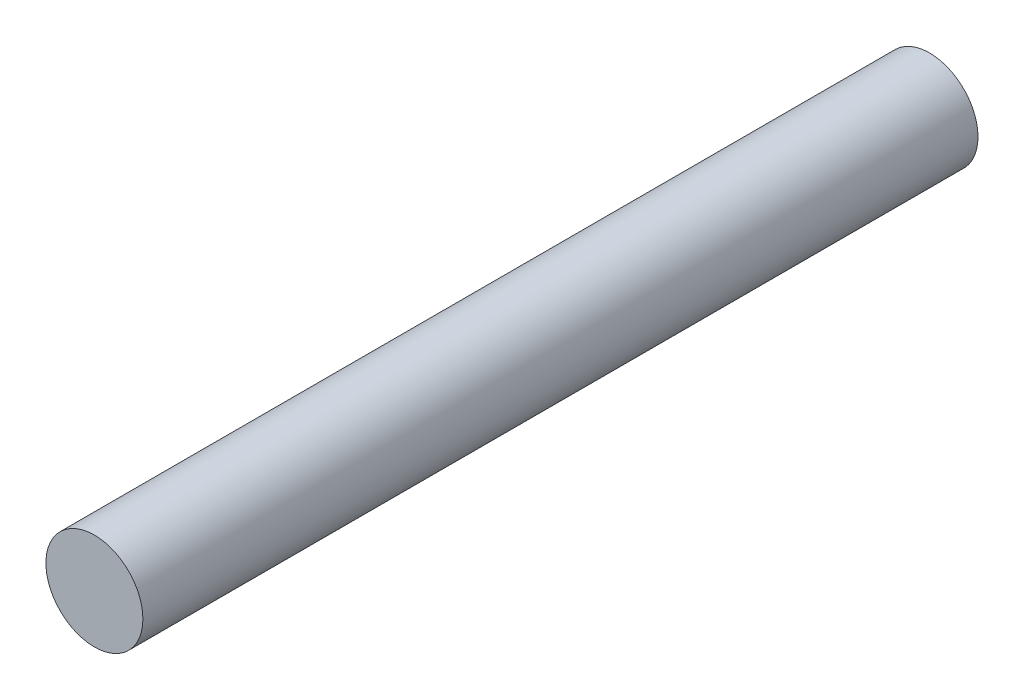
from build123d import *

# Parameters (mm, degrees)
ESQUISSE1_R        = 9
BOSS_EXTRU_1_DEPTH = 155


with BuildPart() as part:
    # Esquisse1 → Boss.-Extru.1 (new body)
    with BuildSketch(Plane.XY):
        Circle(ESQUISSE1_R)
    extrude(amount=BOSS_EXTRU_1_DEPTH)


solid = part.part
